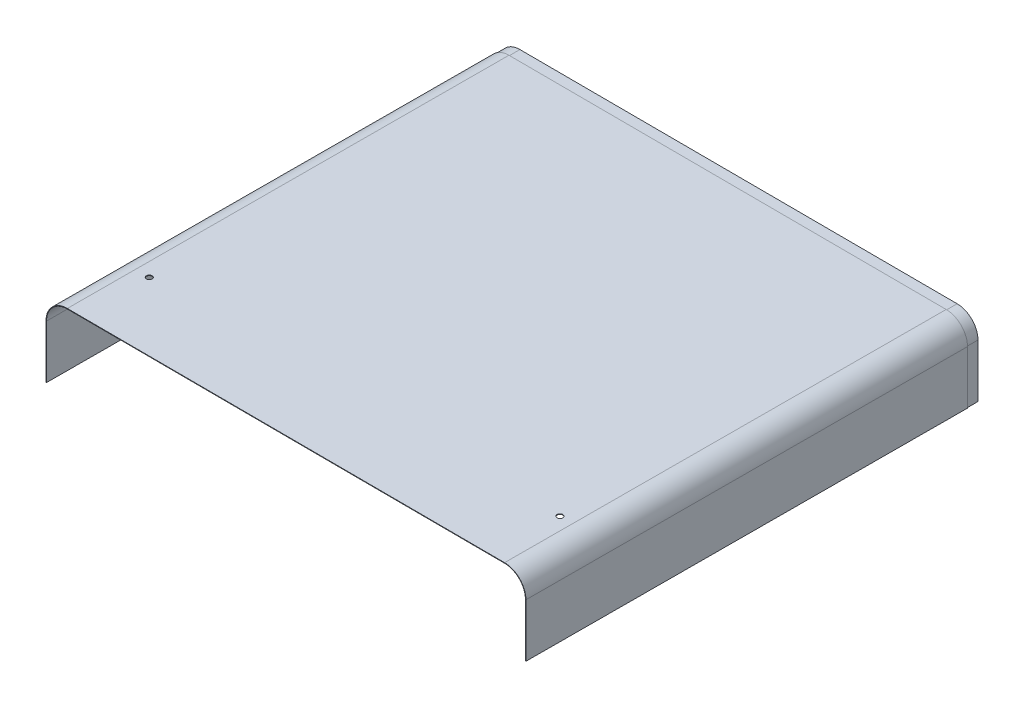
ISO-10303-21;
HEADER;
FILE_DESCRIPTION(('STEP AP214'),'2;1');
FILE_NAME('part.step','',(''),(''),'','','');
FILE_SCHEMA(('AUTOMOTIVE_DESIGN { 1 0 10303 214 1 1 1 1 }'));
ENDSEC;
DATA;
#1=APPLICATION_CONTEXT('core data for automotive mechanical design processes');
#2=APPLICATION_PROTOCOL_DEFINITION('international standard','automotive_design',2000,#1);
#3=PRODUCT_CONTEXT('',#1,'mechanical');
#4=PRODUCT('Part','Part','',(#3));
#5=PRODUCT_RELATED_PRODUCT_CATEGORY('part','',(#4));
#6=PRODUCT_DEFINITION_FORMATION('','',#4);
#7=PRODUCT_DEFINITION_CONTEXT('part definition',#1,'design');
#8=PRODUCT_DEFINITION('design','',#6,#7);
#9=PRODUCT_DEFINITION_SHAPE('','',#8);
#10=(LENGTH_UNIT() NAMED_UNIT(*) SI_UNIT(.MILLI.,.METRE.));
#11=(NAMED_UNIT(*) PLANE_ANGLE_UNIT() SI_UNIT($,.RADIAN.));
#12=(NAMED_UNIT(*) SI_UNIT($,.STERADIAN.) SOLID_ANGLE_UNIT());
#13=UNCERTAINTY_MEASURE_WITH_UNIT(LENGTH_MEASURE(1.E-05),#10,'distance_accuracy_value','');
#14=(GEOMETRIC_REPRESENTATION_CONTEXT(3) GLOBAL_UNCERTAINTY_ASSIGNED_CONTEXT((#13)) GLOBAL_UNIT_ASSIGNED_CONTEXT((#10,
#11,#12)) REPRESENTATION_CONTEXT('',''));
#15=CARTESIAN_POINT('',(0.,0.,0.));
#16=DIRECTION('',(0.,0.,1.));
#17=DIRECTION('',(1.,0.,0.));
#18=AXIS2_PLACEMENT_3D('',#15,#16,#17);
#19=CARTESIAN_POINT('',(327.378468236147,-39.9999999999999,32.7875635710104));
#20=DIRECTION('',(0.00352424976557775,0.,-0.999993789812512));
#21=DIRECTION('',(-0.999993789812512,0.,-0.00352424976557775));
#22=AXIS2_PLACEMENT_3D('',#19,#20,#21);
#23=CYLINDRICAL_SURFACE('',#22,40.0000000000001);
#24=CARTESIAN_POINT('',(327.410186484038,-39.9999999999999,23.7876194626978));
#25=DIRECTION('',(-0.00352424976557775,0.,0.999993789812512));
#26=DIRECTION('',(0.999993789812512,0.,0.00352424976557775));
#27=AXIS2_PLACEMENT_3D('',#24,#25,#26);
#28=CIRCLE('',#27,40.0000000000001);
#29=CARTESIAN_POINT('',(327.410186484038,0.,23.7876194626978));
#30=VERTEX_POINT('',#29);
#31=CARTESIAN_POINT('',(367.409938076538,-39.9999999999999,23.9285894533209));
#32=VERTEX_POINT('',#31);
#33=EDGE_CURVE('E237',#30,#32,#28,.F.);
#34=ORIENTED_EDGE('',*,*,#33,.T.);
#35=DIRECTION('',(0.00352424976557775,0.,-0.999993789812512));
#36=VECTOR('',#35,1.);
#37=CARTESIAN_POINT('',(367.378219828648,-39.9999999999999,32.9285335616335));
#38=LINE('',#37,#36);
#39=CARTESIAN_POINT('',(367.483947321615,-39.9999999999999,2.92871986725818));
#40=VERTEX_POINT('',#39);
#41=EDGE_CURVE('E29',#32,#40,#38,.T.);
#42=ORIENTED_EDGE('',*,*,#41,.T.);
#43=CARTESIAN_POINT('',(327.484195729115,-39.9999999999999,2.78774987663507));
#44=DIRECTION('',(0.00352424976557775,0.,-0.999993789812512));
#45=DIRECTION('',(-0.999993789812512,0.,-0.00352424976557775));
#46=AXIS2_PLACEMENT_3D('',#43,#44,#45);
#47=CIRCLE('',#46,40.0000000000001);
#48=CARTESIAN_POINT('',(327.484195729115,0.,2.78774987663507));
#49=VERTEX_POINT('',#48);
#50=EDGE_CURVE('E293',#49,#40,#47,.T.);
#51=ORIENTED_EDGE('',*,*,#50,.F.);
#52=DIRECTION('',(0.00352424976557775,0.,-0.999993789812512));
#53=VECTOR('',#52,1.);
#54=CARTESIAN_POINT('',(327.378468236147,0.,32.7875635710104));
#55=LINE('',#54,#53);
#56=EDGE_CURVE('E11',#30,#49,#55,.T.);
#57=ORIENTED_EDGE('',*,*,#56,.F.);
#58=EDGE_LOOP('',(#34,#42,#51,#57));
#59=FACE_BOUND('',#58,.T.);
#60=ADVANCED_FACE('F26',(#59),#23,.T.);
#61=CARTESIAN_POINT('',(-512.616315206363,0.,29.8271937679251));
#62=DIRECTION('',(0.,1.,0.));
#63=DIRECTION('',(-1.,0.,0.));
#64=AXIS2_PLACEMENT_3D('',#61,#62,#63);
#65=PLANE('',#64);
#66=DIRECTION('',(0.999993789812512,0.,0.00352424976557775));
#67=VECTOR('',#66,1.);
#68=CARTESIAN_POINT('',(-512.584596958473,0.,20.8272496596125));
#69=LINE('',#68,#67);
#70=CARTESIAN_POINT('',(-512.584596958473,0.,20.8272496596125));
#71=VERTEX_POINT('',#70);
#72=EDGE_CURVE('E41',#71,#30,#69,.T.);
#73=ORIENTED_EDGE('',*,*,#72,.T.);
#74=ORIENTED_EDGE('',*,*,#56,.T.);
#75=DIRECTION('',(0.999993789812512,0.,0.00352424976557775));
#76=VECTOR('',#75,1.);
#77=CARTESIAN_POINT('',(-512.510587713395,0.,-0.172619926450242));
#78=LINE('',#77,#76);
#79=CARTESIAN_POINT('',(-512.510587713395,0.,-0.172619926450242));
#80=VERTEX_POINT('',#79);
#81=EDGE_CURVE('E326',#80,#49,#78,.T.);
#82=ORIENTED_EDGE('',*,*,#81,.F.);
#83=DIRECTION('',(0.00352424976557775,0.,-0.999993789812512));
#84=VECTOR('',#83,1.);
#85=CARTESIAN_POINT('',(-512.616315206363,0.,29.8271937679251));
#86=LINE('',#85,#84);
#87=EDGE_CURVE('E34',#71,#80,#86,.T.);
#88=ORIENTED_EDGE('',*,*,#87,.F.);
#89=EDGE_LOOP('',(#73,#74,#82,#88));
#90=FACE_BOUND('',#89,.T.);
#91=ADVANCED_FACE('F392',(#90),#65,.T.);
#92=CARTESIAN_POINT('',(-512.616315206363,-40.,29.8271937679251));
#93=DIRECTION('',(0.00352424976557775,0.,-0.999993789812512));
#94=DIRECTION('',(-0.999993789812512,0.,-0.00352424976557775));
#95=AXIS2_PLACEMENT_3D('',#92,#93,#94);
#96=CYLINDRICAL_SURFACE('',#95,40.0000000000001);
#97=CARTESIAN_POINT('',(-512.584596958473,-40.,20.8272496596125));
#98=DIRECTION('',(-0.00352424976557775,0.,0.999993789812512));
#99=DIRECTION('',(0.999993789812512,0.,0.00352424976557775));
#100=AXIS2_PLACEMENT_3D('',#97,#98,#99);
#101=CIRCLE('',#100,40.0000000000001);
#102=CARTESIAN_POINT('',(-552.584348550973,-40.,20.6862796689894));
#103=VERTEX_POINT('',#102);
#104=EDGE_CURVE('E49',#103,#71,#101,.F.);
#105=ORIENTED_EDGE('',*,*,#104,.T.);
#106=ORIENTED_EDGE('',*,*,#87,.T.);
#107=CARTESIAN_POINT('',(-512.510587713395,-40.,-0.172619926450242));
#108=DIRECTION('',(0.00352424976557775,0.,-0.999993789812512));
#109=DIRECTION('',(-0.999993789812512,0.,-0.00352424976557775));
#110=AXIS2_PLACEMENT_3D('',#107,#108,#109);
#111=CIRCLE('',#110,40.0000000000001);
#112=CARTESIAN_POINT('',(-552.510339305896,-40.,-0.313589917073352));
#113=VERTEX_POINT('',#112);
#114=EDGE_CURVE('E323',#113,#80,#111,.T.);
#115=ORIENTED_EDGE('',*,*,#114,.F.);
#116=DIRECTION('',(0.00352424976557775,0.,-0.999993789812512));
#117=VECTOR('',#116,1.);
#118=CARTESIAN_POINT('',(-552.616066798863,-40.,29.686223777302));
#119=LINE('',#118,#117);
#120=EDGE_CURVE('E366',#103,#113,#119,.T.);
#121=ORIENTED_EDGE('',*,*,#120,.F.);
#122=EDGE_LOOP('',(#105,#106,#115,#121));
#123=FACE_BOUND('',#122,.T.);
#124=ADVANCED_FACE('F399',(#123),#96,.T.);
#125=CARTESIAN_POINT('',(-552.616066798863,-142.,29.686223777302));
#126=DIRECTION('',(-0.999993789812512,0.,-0.00352424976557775));
#127=DIRECTION('',(-0.00352424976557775,0.,0.999993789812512));
#128=AXIS2_PLACEMENT_3D('',#125,#126,#127);
#129=PLANE('',#128);
#130=DIRECTION('',(0.,1.,0.));
#131=VECTOR('',#130,1.);
#132=CARTESIAN_POINT('',(-552.584348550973,-142.,20.6862796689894));
#133=LINE('',#132,#131);
#134=CARTESIAN_POINT('',(-552.584348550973,-142.,20.6862796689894));
#135=VERTEX_POINT('',#134);
#136=EDGE_CURVE('E233',#135,#103,#133,.T.);
#137=ORIENTED_EDGE('',*,*,#136,.T.);
#138=ORIENTED_EDGE('',*,*,#120,.T.);
#139=DIRECTION('',(0.,1.,0.));
#140=VECTOR('',#139,1.);
#141=CARTESIAN_POINT('',(-552.510339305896,-142.,-0.313589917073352));
#142=LINE('',#141,#140);
#143=CARTESIAN_POINT('',(-552.510339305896,-142.,-0.313589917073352));
#144=VERTEX_POINT('',#143);
#145=EDGE_CURVE('E320',#144,#113,#142,.T.);
#146=ORIENTED_EDGE('',*,*,#145,.F.);
#147=DIRECTION('',(0.00352424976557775,0.,-0.999993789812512));
#148=VECTOR('',#147,1.);
#149=CARTESIAN_POINT('',(-552.616066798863,-142.,29.686223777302));
#150=LINE('',#149,#148);
#151=EDGE_CURVE('E368',#135,#144,#150,.T.);
#152=ORIENTED_EDGE('',*,*,#151,.F.);
#153=EDGE_LOOP('',(#137,#138,#146,#152));
#154=FACE_BOUND('',#153,.T.);
#155=ADVANCED_FACE('F397',(#154),#129,.T.);
#156=CARTESIAN_POINT('',(-551.616073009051,-142.,29.6897480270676));
#157=DIRECTION('',(0.,-1.,0.));
#158=DIRECTION('',(0.,0.,-1.));
#159=AXIS2_PLACEMENT_3D('',#156,#157,#158);
#160=PLANE('',#159);
#161=DIRECTION('',(-0.999993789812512,0.,-0.00352424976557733));
#162=VECTOR('',#161,1.);
#163=CARTESIAN_POINT('',(-551.510345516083,-142.,-0.310065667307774));
#164=LINE('',#163,#162);
#165=CARTESIAN_POINT('',(-551.510345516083,-142.,-0.310065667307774));
#166=VERTEX_POINT('',#165);
#167=EDGE_CURVE('E317',#166,#144,#164,.T.);
#168=ORIENTED_EDGE('',*,*,#167,.F.);
#169=DIRECTION('',(0.00352424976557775,0.,-0.999993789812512));
#170=VECTOR('',#169,1.);
#171=CARTESIAN_POINT('',(-551.616073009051,-142.,29.6897480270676));
#172=LINE('',#171,#170);
#173=CARTESIAN_POINT('',(-551.616073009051,-142.,29.6897480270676));
#174=VERTEX_POINT('',#173);
#175=EDGE_CURVE('E370',#174,#166,#172,.T.);
#176=ORIENTED_EDGE('',*,*,#175,.F.);
#177=DIRECTION('',(-0.999993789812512,0.,-0.00352424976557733));
#178=VECTOR('',#177,1.);
#179=CARTESIAN_POINT('',(-551.616073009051,-142.,29.6897480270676));
#180=LINE('',#179,#178);
#181=CARTESIAN_POINT('',(-552.616066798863,-142.,29.686223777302));
#182=VERTEX_POINT('',#181);
#183=EDGE_CURVE('E353',#174,#182,#180,.T.);
#184=ORIENTED_EDGE('',*,*,#183,.T.);
#185=DIRECTION('',(0.00352424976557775,0.,-0.999993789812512));
#186=VECTOR('',#185,1.);
#187=CARTESIAN_POINT('',(-555.553324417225,-142.,863.123004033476));
#188=LINE('',#187,#186);
#189=CARTESIAN_POINT('',(-555.553324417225,-142.,863.123004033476));
#190=VERTEX_POINT('',#189);
#191=EDGE_CURVE('E279',#190,#182,#188,.T.);
#192=ORIENTED_EDGE('',*,*,#191,.F.);
#193=DIRECTION('',(-0.999993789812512,0.,-0.00352424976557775));
#194=VECTOR('',#193,1.);
#195=CARTESIAN_POINT('',(-555.553324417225,-142.,863.123004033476));
#196=LINE('',#195,#194);
#197=CARTESIAN_POINT('',(-556.553318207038,-142.,863.11947978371));
#198=VERTEX_POINT('',#197);
#199=EDGE_CURVE('E256',#190,#198,#196,.T.);
#200=ORIENTED_EDGE('',*,*,#199,.T.);
#201=DIRECTION('',(0.00352424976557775,0.,-0.999993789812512));
#202=VECTOR('',#201,1.);
#203=CARTESIAN_POINT('',(-556.553318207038,-142.,863.11947978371));
#204=LINE('',#203,#202);
#205=CARTESIAN_POINT('',(-553.584342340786,-142.,20.6827554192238));
#206=VERTEX_POINT('',#205);
#207=EDGE_CURVE('E282',#198,#206,#204,.T.);
#208=ORIENTED_EDGE('',*,*,#207,.T.);
#209=DIRECTION('',(-0.999993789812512,0.,-0.00352424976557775));
#210=VECTOR('',#209,1.);
#211=CARTESIAN_POINT('',(-552.584348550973,-142.,20.6862796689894));
#212=LINE('',#211,#210);
#213=EDGE_CURVE('E230',#135,#206,#212,.T.);
#214=ORIENTED_EDGE('',*,*,#213,.F.);
#215=ORIENTED_EDGE('',*,*,#151,.T.);
#216=EDGE_LOOP('',(#168,#176,#184,#192,#200,#208,#214,#215));
#217=FACE_BOUND('',#216,.T.);
#218=ADVANCED_FACE('F403',(#217),#160,.T.);
#219=CARTESIAN_POINT('',(-551.616073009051,-40.,29.6897480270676));
#220=DIRECTION('',(0.999993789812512,0.,0.00352424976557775));
#221=DIRECTION('',(0.00352424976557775,0.,-0.999993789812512));
#222=AXIS2_PLACEMENT_3D('',#219,#220,#221);
#223=PLANE('',#222);
#224=DIRECTION('',(0.,-1.,0.));
#225=VECTOR('',#224,1.);
#226=CARTESIAN_POINT('',(-551.510345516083,-40.,-0.310065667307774));
#227=LINE('',#226,#225);
#228=CARTESIAN_POINT('',(-551.510345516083,-40.,-0.310065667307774));
#229=VERTEX_POINT('',#228);
#230=EDGE_CURVE('E314',#229,#166,#227,.T.);
#231=ORIENTED_EDGE('',*,*,#230,.F.);
#232=DIRECTION('',(0.00352424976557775,0.,-0.999993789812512));
#233=VECTOR('',#232,1.);
#234=CARTESIAN_POINT('',(-551.616073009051,-40.,29.6897480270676));
#235=LINE('',#234,#233);
#236=CARTESIAN_POINT('',(-551.616073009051,-40.,29.6897480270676));
#237=VERTEX_POINT('',#236);
#238=EDGE_CURVE('E372',#237,#229,#235,.T.);
#239=ORIENTED_EDGE('',*,*,#238,.F.);
#240=DIRECTION('',(0.,-1.,0.));
#241=VECTOR('',#240,1.);
#242=CARTESIAN_POINT('',(-551.616073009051,-40.,29.6897480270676));
#243=LINE('',#242,#241);
#244=EDGE_CURVE('E350',#237,#174,#243,.T.);
#245=ORIENTED_EDGE('',*,*,#244,.T.);
#246=ORIENTED_EDGE('',*,*,#175,.T.);
#247=EDGE_LOOP('',(#231,#239,#245,#246));
#248=FACE_BOUND('',#247,.T.);
#249=ADVANCED_FACE('F448',(#248),#223,.T.);
#250=CARTESIAN_POINT('',(-512.616315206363,-40.,29.8271937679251));
#251=DIRECTION('',(0.00352424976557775,0.,-0.999993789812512));
#252=DIRECTION('',(-0.999993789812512,0.,-0.00352424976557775));
#253=AXIS2_PLACEMENT_3D('',#250,#251,#252);
#254=CYLINDRICAL_SURFACE('',#253,39.);
#255=CARTESIAN_POINT('',(-512.510587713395,-40.,-0.172619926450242));
#256=DIRECTION('',(-0.00352424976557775,0.,0.999993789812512));
#257=DIRECTION('',(-0.999993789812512,0.,-0.00352424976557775));
#258=AXIS2_PLACEMENT_3D('',#255,#256,#257);
#259=CIRCLE('',#258,39.);
#260=CARTESIAN_POINT('',(-512.510587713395,-0.999999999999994,-0.172619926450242));
#261=VERTEX_POINT('',#260);
#262=EDGE_CURVE('E311',#261,#229,#259,.T.);
#263=ORIENTED_EDGE('',*,*,#262,.F.);
#264=DIRECTION('',(0.00352424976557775,0.,-0.999993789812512));
#265=VECTOR('',#264,1.);
#266=CARTESIAN_POINT('',(-512.616315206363,-0.999999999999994,29.8271937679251));
#267=LINE('',#266,#265);
#268=CARTESIAN_POINT('',(-512.616315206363,-0.999999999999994,29.8271937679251));
#269=VERTEX_POINT('',#268);
#270=EDGE_CURVE('E374',#269,#261,#267,.T.);
#271=ORIENTED_EDGE('',*,*,#270,.F.);
#272=CARTESIAN_POINT('',(-512.616315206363,-40.,29.8271937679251));
#273=DIRECTION('',(-0.00352424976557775,0.,0.999993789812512));
#274=DIRECTION('',(-0.999993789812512,0.,-0.00352424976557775));
#275=AXIS2_PLACEMENT_3D('',#272,#273,#274);
#276=CIRCLE('',#275,39.);
#277=EDGE_CURVE('E347',#269,#237,#276,.T.);
#278=ORIENTED_EDGE('',*,*,#277,.T.);
#279=ORIENTED_EDGE('',*,*,#238,.T.);
#280=EDGE_LOOP('',(#263,#271,#278,#279));
#281=FACE_BOUND('',#280,.T.);
#282=ADVANCED_FACE('F451',(#281),#254,.F.);
#283=CARTESIAN_POINT('',(327.378468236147,-0.999999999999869,32.7875635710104));
#284=DIRECTION('',(0.,-1.,0.));
#285=DIRECTION('',(1.,0.,0.));
#286=AXIS2_PLACEMENT_3D('',#283,#284,#285);
#287=PLANE('',#286);
#288=DIRECTION('',(-0.999993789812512,0.,-0.00352424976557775));
#289=VECTOR('',#288,1.);
#290=CARTESIAN_POINT('',(327.484195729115,-0.999999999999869,2.78774987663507));
#291=LINE('',#290,#289);
#292=CARTESIAN_POINT('',(327.484195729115,-0.999999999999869,2.78774987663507));
#293=VERTEX_POINT('',#292);
#294=EDGE_CURVE('E308',#293,#261,#291,.T.);
#295=ORIENTED_EDGE('',*,*,#294,.F.);
#296=DIRECTION('',(0.00352424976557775,0.,-0.999993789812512));
#297=VECTOR('',#296,1.);
#298=CARTESIAN_POINT('',(327.378468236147,-0.999999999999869,32.7875635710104));
#299=LINE('',#298,#297);
#300=CARTESIAN_POINT('',(327.378468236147,-0.999999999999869,32.7875635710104));
#301=VERTEX_POINT('',#300);
#302=EDGE_CURVE('E376',#301,#293,#299,.T.);
#303=ORIENTED_EDGE('',*,*,#302,.F.);
#304=DIRECTION('',(-0.999993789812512,0.,-0.00352424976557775));
#305=VECTOR('',#304,1.);
#306=CARTESIAN_POINT('',(327.378468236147,-0.999999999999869,32.7875635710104));
#307=LINE('',#306,#305);
#308=EDGE_CURVE('E344',#301,#269,#307,.T.);
#309=ORIENTED_EDGE('',*,*,#308,.T.);
#310=ORIENTED_EDGE('',*,*,#270,.T.);
#311=EDGE_LOOP('',(#295,#303,#309,#310));
#312=FACE_BOUND('',#311,.T.);
#313=ADVANCED_FACE('F456',(#312),#287,.T.);
#314=CARTESIAN_POINT('',(327.378468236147,-39.9999999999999,32.7875635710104));
#315=DIRECTION('',(0.00352424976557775,0.,-0.999993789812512));
#316=DIRECTION('',(-0.999993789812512,0.,-0.00352424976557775));
#317=AXIS2_PLACEMENT_3D('',#314,#315,#316);
#318=CYLINDRICAL_SURFACE('',#317,39.0000000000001);
#319=CARTESIAN_POINT('',(327.484195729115,-39.9999999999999,2.78774987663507));
#320=DIRECTION('',(-0.00352424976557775,0.,0.999993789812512));
#321=DIRECTION('',(-0.999993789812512,0.,-0.00352424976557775));
#322=AXIS2_PLACEMENT_3D('',#319,#320,#321);
#323=CIRCLE('',#322,39.0000000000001);
#324=CARTESIAN_POINT('',(366.483953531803,-39.9999999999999,2.9251956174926));
#325=VERTEX_POINT('',#324);
#326=EDGE_CURVE('E305',#325,#293,#323,.T.);
#327=ORIENTED_EDGE('',*,*,#326,.F.);
#328=DIRECTION('',(0.00352424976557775,0.,-0.999993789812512));
#329=VECTOR('',#328,1.);
#330=CARTESIAN_POINT('',(366.378226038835,-39.9999999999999,32.925009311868));
#331=LINE('',#330,#329);
#332=CARTESIAN_POINT('',(366.378226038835,-39.9999999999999,32.925009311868));
#333=VERTEX_POINT('',#332);
#334=EDGE_CURVE('E378',#333,#325,#331,.T.);
#335=ORIENTED_EDGE('',*,*,#334,.F.);
#336=CARTESIAN_POINT('',(327.378468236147,-39.9999999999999,32.7875635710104));
#337=DIRECTION('',(-0.00352424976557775,0.,0.999993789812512));
#338=DIRECTION('',(-0.999993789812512,0.,-0.00352424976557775));
#339=AXIS2_PLACEMENT_3D('',#336,#337,#338);
#340=CIRCLE('',#339,39.0000000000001);
#341=EDGE_CURVE('E341',#333,#301,#340,.T.);
#342=ORIENTED_EDGE('',*,*,#341,.T.);
#343=ORIENTED_EDGE('',*,*,#302,.T.);
#344=EDGE_LOOP('',(#327,#335,#342,#343));
#345=FACE_BOUND('',#344,.T.);
#346=ADVANCED_FACE('F459',(#345),#318,.F.);
#347=CARTESIAN_POINT('',(366.378226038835,-142.,32.925009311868));
#348=DIRECTION('',(-0.999993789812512,0.,-0.00352424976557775));
#349=DIRECTION('',(-0.00352424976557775,0.,0.999993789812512));
#350=AXIS2_PLACEMENT_3D('',#347,#348,#349);
#351=PLANE('',#350);
#352=DIRECTION('',(0.,1.,0.));
#353=VECTOR('',#352,1.);
#354=CARTESIAN_POINT('',(366.483953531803,-142.,2.9251956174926));
#355=LINE('',#354,#353);
#356=CARTESIAN_POINT('',(366.483953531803,-142.,2.9251956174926));
#357=VERTEX_POINT('',#356);
#358=EDGE_CURVE('E302',#357,#325,#355,.T.);
#359=ORIENTED_EDGE('',*,*,#358,.F.);
#360=DIRECTION('',(0.00352424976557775,0.,-0.999993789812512));
#361=VECTOR('',#360,1.);
#362=CARTESIAN_POINT('',(366.378226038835,-142.,32.925009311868));
#363=LINE('',#362,#361);
#364=CARTESIAN_POINT('',(366.378226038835,-142.,32.925009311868));
#365=VERTEX_POINT('',#364);
#366=EDGE_CURVE('E380',#365,#357,#363,.T.);
#367=ORIENTED_EDGE('',*,*,#366,.F.);
#368=DIRECTION('',(0.,1.,0.));
#369=VECTOR('',#368,1.);
#370=CARTESIAN_POINT('',(366.378226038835,-142.,32.925009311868));
#371=LINE('',#370,#369);
#372=EDGE_CURVE('E338',#365,#333,#371,.T.);
#373=ORIENTED_EDGE('',*,*,#372,.T.);
#374=ORIENTED_EDGE('',*,*,#334,.T.);
#375=EDGE_LOOP('',(#359,#367,#373,#374));
#376=FACE_BOUND('',#375,.T.);
#377=ADVANCED_FACE('F462',(#376),#351,.T.);
#378=CARTESIAN_POINT('',(367.378219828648,-142.,32.9285335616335));
#379=DIRECTION('',(0.,-1.,0.));
#380=DIRECTION('',(0.,0.,-1.));
#381=AXIS2_PLACEMENT_3D('',#378,#379,#380);
#382=PLANE('',#381);
#383=DIRECTION('',(-0.999993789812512,0.,-0.00352424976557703));
#384=VECTOR('',#383,1.);
#385=CARTESIAN_POINT('',(367.483947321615,-142.,2.92871986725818));
#386=LINE('',#385,#384);
#387=CARTESIAN_POINT('',(367.483947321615,-142.,2.92871986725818));
#388=VERTEX_POINT('',#387);
#389=EDGE_CURVE('E299',#388,#357,#386,.T.);
#390=ORIENTED_EDGE('',*,*,#389,.F.);
#391=DIRECTION('',(0.00352424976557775,0.,-0.999993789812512));
#392=VECTOR('',#391,1.);
#393=CARTESIAN_POINT('',(367.378219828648,-142.,32.9285335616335));
#394=LINE('',#393,#392);
#395=CARTESIAN_POINT('',(367.409938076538,-142.,23.9285894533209));
#396=VERTEX_POINT('',#395);
#397=EDGE_CURVE('E214',#396,#388,#394,.T.);
#398=ORIENTED_EDGE('',*,*,#397,.F.);
#399=DIRECTION('',(-0.999993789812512,0.,-0.00352424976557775));
#400=VECTOR('',#399,1.);
#401=CARTESIAN_POINT('',(368.409931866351,-142.,23.9321137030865));
#402=LINE('',#401,#400);
#403=CARTESIAN_POINT('',(368.409931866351,-142.,23.9321137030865));
#404=VERTEX_POINT('',#403);
#405=EDGE_CURVE('E206',#404,#396,#402,.T.);
#406=ORIENTED_EDGE('',*,*,#405,.F.);
#407=DIRECTION('',(0.00352424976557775,0.,-0.999993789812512));
#408=VECTOR('',#407,1.);
#409=CARTESIAN_POINT('',(365.440956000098,-142.,866.368838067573));
#410=LINE('',#409,#408);
#411=CARTESIAN_POINT('',(365.440956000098,-142.,866.368838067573));
#412=VERTEX_POINT('',#411);
#413=EDGE_CURVE('E188',#412,#404,#410,.T.);
#414=ORIENTED_EDGE('',*,*,#413,.F.);
#415=DIRECTION('',(-0.999993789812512,0.,-0.00352424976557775));
#416=VECTOR('',#415,1.);
#417=CARTESIAN_POINT('',(365.440956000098,-142.,866.368838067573));
#418=LINE('',#417,#416);
#419=CARTESIAN_POINT('',(364.440962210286,-142.,866.365313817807));
#420=VERTEX_POINT('',#419);
#421=EDGE_CURVE('E241',#412,#420,#418,.T.);
#422=ORIENTED_EDGE('',*,*,#421,.T.);
#423=DIRECTION('',(0.00352424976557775,0.,-0.999993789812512));
#424=VECTOR('',#423,1.);
#425=CARTESIAN_POINT('',(364.440962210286,-142.,866.365313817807));
#426=LINE('',#425,#424);
#427=CARTESIAN_POINT('',(367.378219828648,-142.,32.9285335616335));
#428=VERTEX_POINT('',#427);
#429=EDGE_CURVE('E198',#420,#428,#426,.T.);
#430=ORIENTED_EDGE('',*,*,#429,.T.);
#431=DIRECTION('',(-0.999993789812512,0.,-0.00352424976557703));
#432=VECTOR('',#431,1.);
#433=CARTESIAN_POINT('',(367.378219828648,-142.,32.9285335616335));
#434=LINE('',#433,#432);
#435=EDGE_CURVE('E335',#428,#365,#434,.T.);
#436=ORIENTED_EDGE('',*,*,#435,.T.);
#437=ORIENTED_EDGE('',*,*,#366,.T.);
#438=EDGE_LOOP('',(#390,#398,#406,#414,#422,#430,#436,#437));
#439=FACE_BOUND('',#438,.T.);
#440=ADVANCED_FACE('F213',(#439),#382,.T.);
#441=CARTESIAN_POINT('',(367.378219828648,-39.9999999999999,32.9285335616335));
#442=DIRECTION('',(0.999993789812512,0.,0.00352424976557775));
#443=DIRECTION('',(0.00352424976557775,0.,-0.999993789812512));
#444=AXIS2_PLACEMENT_3D('',#441,#442,#443);
#445=PLANE('',#444);
#446=DIRECTION('',(0.,-1.,0.));
#447=VECTOR('',#446,1.);
#448=CARTESIAN_POINT('',(367.409938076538,-39.9999999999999,23.9285894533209));
#449=LINE('',#448,#447);
#450=EDGE_CURVE('E215',#32,#396,#449,.T.);
#451=ORIENTED_EDGE('',*,*,#450,.T.);
#452=ORIENTED_EDGE('',*,*,#397,.T.);
#453=DIRECTION('',(0.,-1.,0.));
#454=VECTOR('',#453,1.);
#455=CARTESIAN_POINT('',(367.483947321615,-39.9999999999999,2.92871986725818));
#456=LINE('',#455,#454);
#457=EDGE_CURVE('E296',#40,#388,#456,.T.);
#458=ORIENTED_EDGE('',*,*,#457,.F.);
#459=ORIENTED_EDGE('',*,*,#41,.F.);
#460=EDGE_LOOP('',(#451,#452,#458,#459));
#461=FACE_BOUND('',#460,.T.);
#462=ADVANCED_FACE('F387',(#461),#445,.T.);
#463=CARTESIAN_POINT('',(327.378468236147,-39.9999999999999,32.7875635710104));
#464=DIRECTION('',(0.00352424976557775,0.,-0.999993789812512));
#465=DIRECTION('',(-0.999993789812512,0.,-0.00352424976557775));
#466=AXIS2_PLACEMENT_3D('',#463,#464,#465);
#467=PLANE('',#466);
#468=CARTESIAN_POINT('',(327.378468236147,-39.9999999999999,32.7875635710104));
#469=DIRECTION('',(0.00352424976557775,0.,-0.999993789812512));
#470=DIRECTION('',(-0.999993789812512,0.,-0.00352424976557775));
#471=AXIS2_PLACEMENT_3D('',#468,#469,#470);
#472=CIRCLE('',#471,40.0000000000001);
#473=CARTESIAN_POINT('',(327.378468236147,0.,32.7875635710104));
#474=VERTEX_POINT('',#473);
#475=CARTESIAN_POINT('',(367.378219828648,-39.9999999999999,32.9285335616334));
#476=VERTEX_POINT('',#475);
#477=EDGE_CURVE('E329',#474,#476,#472,.T.);
#478=ORIENTED_EDGE('',*,*,#477,.F.);
#479=DIRECTION('',(0.999993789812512,0.,0.00352424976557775));
#480=VECTOR('',#479,1.);
#481=CARTESIAN_POINT('',(-512.616315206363,0.,29.8271937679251));
#482=LINE('',#481,#480);
#483=CARTESIAN_POINT('',(-512.616315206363,0.,29.8271937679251));
#484=VERTEX_POINT('',#483);
#485=EDGE_CURVE('E362',#484,#474,#482,.T.);
#486=ORIENTED_EDGE('',*,*,#485,.F.);
#487=CARTESIAN_POINT('',(-512.616315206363,-40.,29.8271937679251));
#488=DIRECTION('',(0.00352424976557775,0.,-0.999993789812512));
#489=DIRECTION('',(-0.999993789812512,0.,-0.00352424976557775));
#490=AXIS2_PLACEMENT_3D('',#487,#488,#489);
#491=CIRCLE('',#490,40.0000000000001);
#492=CARTESIAN_POINT('',(-552.616066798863,-40.,29.686223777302));
#493=VERTEX_POINT('',#492);
#494=EDGE_CURVE('E359',#493,#484,#491,.T.);
#495=ORIENTED_EDGE('',*,*,#494,.F.);
#496=DIRECTION('',(0.,1.,0.));
#497=VECTOR('',#496,1.);
#498=CARTESIAN_POINT('',(-552.616066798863,-142.,29.686223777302));
#499=LINE('',#498,#497);
#500=EDGE_CURVE('E356',#182,#493,#499,.T.);
#501=ORIENTED_EDGE('',*,*,#500,.F.);
#502=ORIENTED_EDGE('',*,*,#183,.F.);
#503=ORIENTED_EDGE('',*,*,#244,.F.);
#504=ORIENTED_EDGE('',*,*,#277,.F.);
#505=ORIENTED_EDGE('',*,*,#308,.F.);
#506=ORIENTED_EDGE('',*,*,#341,.F.);
#507=ORIENTED_EDGE('',*,*,#372,.F.);
#508=ORIENTED_EDGE('',*,*,#435,.F.);
#509=DIRECTION('',(0.,-1.,0.));
#510=VECTOR('',#509,1.);
#511=CARTESIAN_POINT('',(367.378219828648,-39.9999999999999,32.9285335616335));
#512=LINE('',#511,#510);
#513=EDGE_CURVE('E332',#476,#428,#512,.T.);
#514=ORIENTED_EDGE('',*,*,#513,.F.);
#515=EDGE_LOOP('',(#478,#486,#495,#501,#502,#503,#504,#505,#506,#507,#508,#514));
#516=FACE_BOUND('',#515,.T.);
#517=ADVANCED_FACE('F428',(#516),#467,.F.);
#518=CARTESIAN_POINT('',(327.484195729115,-39.9999999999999,2.78774987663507));
#519=DIRECTION('',(0.00352424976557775,0.,-0.999993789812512));
#520=DIRECTION('',(-0.999993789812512,0.,-0.00352424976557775));
#521=AXIS2_PLACEMENT_3D('',#518,#519,#520);
#522=PLANE('',#521);
#523=ORIENTED_EDGE('',*,*,#50,.T.);
#524=ORIENTED_EDGE('',*,*,#457,.T.);
#525=ORIENTED_EDGE('',*,*,#389,.T.);
#526=ORIENTED_EDGE('',*,*,#358,.T.);
#527=ORIENTED_EDGE('',*,*,#326,.T.);
#528=ORIENTED_EDGE('',*,*,#294,.T.);
#529=ORIENTED_EDGE('',*,*,#262,.T.);
#530=ORIENTED_EDGE('',*,*,#230,.T.);
#531=ORIENTED_EDGE('',*,*,#167,.T.);
#532=ORIENTED_EDGE('',*,*,#145,.T.);
#533=ORIENTED_EDGE('',*,*,#114,.T.);
#534=ORIENTED_EDGE('',*,*,#81,.T.);
#535=EDGE_LOOP('',(#523,#524,#525,#526,#527,#528,#529,#530,#531,#532,#533,#534));
#536=FACE_BOUND('',#535,.T.);
#537=ADVANCED_FACE('F389',(#536),#522,.T.);
#538=CARTESIAN_POINT('',(364.440962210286,-39.9999999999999,866.365313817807));
#539=DIRECTION('',(0.999993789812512,0.,0.00352424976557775));
#540=DIRECTION('',(0.00352424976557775,0.,-0.999993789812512));
#541=AXIS2_PLACEMENT_3D('',#538,#539,#540);
#542=PLANE('',#541);
#543=DIRECTION('',(0.00352424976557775,0.,-0.999993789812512));
#544=VECTOR('',#543,1.);
#545=CARTESIAN_POINT('',(364.440962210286,-39.9999999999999,866.365313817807));
#546=LINE('',#545,#544);
#547=CARTESIAN_POINT('',(364.440962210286,-39.9999999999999,866.365313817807));
#548=VERTEX_POINT('',#547);
#549=EDGE_CURVE('E267',#548,#476,#546,.T.);
#550=ORIENTED_EDGE('',*,*,#549,.T.);
#551=ORIENTED_EDGE('',*,*,#513,.T.);
#552=ORIENTED_EDGE('',*,*,#429,.F.);
#553=DIRECTION('',(0.,-1.,0.));
#554=VECTOR('',#553,1.);
#555=CARTESIAN_POINT('',(364.440962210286,-39.9999999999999,866.365313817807));
#556=LINE('',#555,#554);
#557=EDGE_CURVE('E239',#548,#420,#556,.T.);
#558=ORIENTED_EDGE('',*,*,#557,.F.);
#559=EDGE_LOOP('',(#550,#551,#552,#558));
#560=FACE_BOUND('',#559,.T.);
#561=ADVANCED_FACE('F425',(#560),#542,.F.);
#562=CARTESIAN_POINT('',(-555.553324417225,-142.,863.123004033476));
#563=DIRECTION('',(-0.999993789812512,0.,-0.00352424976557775));
#564=DIRECTION('',(-0.00352424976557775,0.,0.999993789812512));
#565=AXIS2_PLACEMENT_3D('',#562,#563,#564);
#566=PLANE('',#565);
#567=ORIENTED_EDGE('',*,*,#191,.T.);
#568=ORIENTED_EDGE('',*,*,#500,.T.);
#569=DIRECTION('',(0.00352424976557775,0.,-0.999993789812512));
#570=VECTOR('',#569,1.);
#571=CARTESIAN_POINT('',(-555.553324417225,-40.,863.123004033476));
#572=LINE('',#571,#570);
#573=CARTESIAN_POINT('',(-555.553324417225,-40.,863.123004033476));
#574=VERTEX_POINT('',#573);
#575=EDGE_CURVE('E276',#574,#493,#572,.T.);
#576=ORIENTED_EDGE('',*,*,#575,.F.);
#577=DIRECTION('',(0.,1.,0.));
#578=VECTOR('',#577,1.);
#579=CARTESIAN_POINT('',(-555.553324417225,-142.,863.123004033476));
#580=LINE('',#579,#578);
#581=EDGE_CURVE('E259',#190,#574,#580,.T.);
#582=ORIENTED_EDGE('',*,*,#581,.F.);
#583=EDGE_LOOP('',(#567,#568,#576,#582));
#584=FACE_BOUND('',#583,.T.);
#585=ADVANCED_FACE('F444',(#584),#566,.F.);
#586=CARTESIAN_POINT('',(-515.553572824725,-40.,863.263974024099));
#587=DIRECTION('',(0.00352424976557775,0.,-0.999993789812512));
#588=DIRECTION('',(-0.999993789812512,0.,-0.00352424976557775));
#589=AXIS2_PLACEMENT_3D('',#586,#587,#588);
#590=CYLINDRICAL_SURFACE('',#589,40.0000000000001);
#591=ORIENTED_EDGE('',*,*,#575,.T.);
#592=ORIENTED_EDGE('',*,*,#494,.T.);
#593=DIRECTION('',(0.00352424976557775,0.,-0.999993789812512));
#594=VECTOR('',#593,1.);
#595=CARTESIAN_POINT('',(-515.553572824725,0.,863.263974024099));
#596=LINE('',#595,#594);
#597=CARTESIAN_POINT('',(-515.553572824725,0.,863.263974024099));
#598=VERTEX_POINT('',#597);
#599=EDGE_CURVE('E273',#598,#484,#596,.T.);
#600=ORIENTED_EDGE('',*,*,#599,.F.);
#601=CARTESIAN_POINT('',(-515.553572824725,-40.,863.263974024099));
#602=DIRECTION('',(-0.00352424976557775,0.,0.999993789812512));
#603=DIRECTION('',(0.999993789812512,0.,0.00352424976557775));
#604=AXIS2_PLACEMENT_3D('',#601,#602,#603);
#605=CIRCLE('',#604,40.0000000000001);
#606=EDGE_CURVE('E261',#574,#598,#605,.F.);
#607=ORIENTED_EDGE('',*,*,#606,.F.);
#608=EDGE_LOOP('',(#591,#592,#600,#607));
#609=FACE_BOUND('',#608,.T.);
#610=ADVANCED_FACE('F439',(#609),#590,.F.);
#611=CARTESIAN_POINT('',(-515.553572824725,0.,863.263974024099));
#612=DIRECTION('',(0.,1.,0.));
#613=DIRECTION('',(-1.,0.,0.));
#614=AXIS2_PLACEMENT_3D('',#611,#612,#613);
#615=PLANE('',#614);
#616=CARTESIAN_POINT('',(-488.595584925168,0.,733.35817396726));
#617=DIRECTION('',(0.,1.,0.));
#618=DIRECTION('',(-1.,0.,0.));
#619=AXIS2_PLACEMENT_3D('',#616,#617,#618);
#620=CIRCLE('',#619,5.50000000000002);
#621=CARTESIAN_POINT('',(-494.095584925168,0.,733.35817396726));
#622=VERTEX_POINT('',#621);
#623=EDGE_CURVE('E594',#622,#622,#620,.T.);
#624=ORIENTED_EDGE('',*,*,#623,.T.);
#625=EDGE_LOOP('',(#624));
#626=FACE_BOUND('',#625,.T.);
#627=CARTESIAN_POINT('',(300.399515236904,1.02348685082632E-13,736.138807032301));
#628=DIRECTION('',(0.,1.,0.));
#629=DIRECTION('',(-1.,0.,0.));
#630=AXIS2_PLACEMENT_3D('',#627,#628,#629);
#631=CIRCLE('',#630,5.50000000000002);
#632=CARTESIAN_POINT('',(294.899515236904,1.01797806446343E-13,736.138807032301));
#633=VERTEX_POINT('',#632);
#634=EDGE_CURVE('E217',#633,#633,#631,.T.);
#635=ORIENTED_EDGE('',*,*,#634,.T.);
#636=EDGE_LOOP('',(#635));
#637=FACE_BOUND('',#636,.T.);
#638=ORIENTED_EDGE('',*,*,#599,.T.);
#639=ORIENTED_EDGE('',*,*,#485,.T.);
#640=DIRECTION('',(0.00352424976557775,0.,-0.999993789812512));
#641=VECTOR('',#640,1.);
#642=CARTESIAN_POINT('',(324.441210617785,1.38594814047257E-13,866.224343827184));
#643=LINE('',#642,#641);
#644=CARTESIAN_POINT('',(324.441210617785,1.38594814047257E-13,866.224343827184));
#645=VERTEX_POINT('',#644);
#646=EDGE_CURVE('E270',#645,#474,#643,.T.);
#647=ORIENTED_EDGE('',*,*,#646,.F.);
#648=DIRECTION('',(0.999993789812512,0.,0.00352424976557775));
#649=VECTOR('',#648,1.);
#650=CARTESIAN_POINT('',(-515.553572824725,0.,863.263974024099));
#651=LINE('',#650,#649);
#652=EDGE_CURVE('E263',#598,#645,#651,.T.);
#653=ORIENTED_EDGE('',*,*,#652,.F.);
#654=EDGE_LOOP('',(#638,#639,#647,#653));
#655=FACE_BOUND('',#654,.T.);
#656=ADVANCED_FACE('F436',(#626,#637,#655),#615,.F.);
#657=CARTESIAN_POINT('',(324.441210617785,-39.9999999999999,866.224343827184));
#658=DIRECTION('',(0.00352424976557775,0.,-0.999993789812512));
#659=DIRECTION('',(-0.999993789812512,0.,-0.00352424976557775));
#660=AXIS2_PLACEMENT_3D('',#657,#658,#659);
#661=CYLINDRICAL_SURFACE('',#660,40.0000000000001);
#662=ORIENTED_EDGE('',*,*,#646,.T.);
#663=ORIENTED_EDGE('',*,*,#477,.T.);
#664=ORIENTED_EDGE('',*,*,#549,.F.);
#665=CARTESIAN_POINT('',(324.441210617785,-39.9999999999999,866.224343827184));
#666=DIRECTION('',(-0.00352424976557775,0.,0.999993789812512));
#667=DIRECTION('',(0.999993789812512,0.,0.00352424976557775));
#668=AXIS2_PLACEMENT_3D('',#665,#666,#667);
#669=CIRCLE('',#668,40.0000000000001);
#670=EDGE_CURVE('E265',#645,#548,#669,.F.);
#671=ORIENTED_EDGE('',*,*,#670,.F.);
#672=EDGE_LOOP('',(#662,#663,#664,#671));
#673=FACE_BOUND('',#672,.T.);
#674=ADVANCED_FACE('F431',(#673),#661,.F.);
#675=CARTESIAN_POINT('',(365.440956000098,-39.9999999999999,866.368838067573));
#676=DIRECTION('',(0.999993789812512,0.,0.00352424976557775));
#677=DIRECTION('',(0.00352424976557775,0.,-0.999993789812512));
#678=AXIS2_PLACEMENT_3D('',#675,#676,#677);
#679=PLANE('',#678);
#680=ORIENTED_EDGE('',*,*,#413,.T.);
#681=DIRECTION('',(0.,-1.,0.));
#682=VECTOR('',#681,1.);
#683=CARTESIAN_POINT('',(368.409931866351,-39.9999999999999,23.9321137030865));
#684=LINE('',#683,#682);
#685=CARTESIAN_POINT('',(368.409931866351,-39.9999999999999,23.9321137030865));
#686=VERTEX_POINT('',#685);
#687=EDGE_CURVE('E191',#686,#404,#684,.T.);
#688=ORIENTED_EDGE('',*,*,#687,.F.);
#689=DIRECTION('',(0.00352424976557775,0.,-0.999993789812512));
#690=VECTOR('',#689,1.);
#691=CARTESIAN_POINT('',(365.440956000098,-39.9999999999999,866.368838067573));
#692=LINE('',#691,#690);
#693=CARTESIAN_POINT('',(365.440956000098,-39.9999999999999,866.368838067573));
#694=VERTEX_POINT('',#693);
#695=EDGE_CURVE('E199',#694,#686,#692,.T.);
#696=ORIENTED_EDGE('',*,*,#695,.F.);
#697=DIRECTION('',(0.,-1.,0.));
#698=VECTOR('',#697,1.);
#699=CARTESIAN_POINT('',(365.440956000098,-39.9999999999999,866.368838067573));
#700=LINE('',#699,#698);
#701=EDGE_CURVE('E193',#694,#412,#700,.T.);
#702=ORIENTED_EDGE('',*,*,#701,.T.);
#703=EDGE_LOOP('',(#680,#688,#696,#702));
#704=FACE_BOUND('',#703,.T.);
#705=ADVANCED_FACE('F190',(#704),#679,.T.);
#706=CARTESIAN_POINT('',(324.441210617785,-39.9999999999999,866.224343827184));
#707=DIRECTION('',(0.00352424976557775,0.,-0.999993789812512));
#708=DIRECTION('',(-0.999993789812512,0.,-0.00352424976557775));
#709=AXIS2_PLACEMENT_3D('',#706,#707,#708);
#710=CYLINDRICAL_SURFACE('',#709,41.0000000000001);
#711=ORIENTED_EDGE('',*,*,#695,.T.);
#712=CARTESIAN_POINT('',(327.410186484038,-39.9999999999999,23.7876194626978));
#713=DIRECTION('',(0.00352424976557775,0.,-0.999993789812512));
#714=DIRECTION('',(0.999993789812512,0.,0.00352424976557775));
#715=AXIS2_PLACEMENT_3D('',#712,#713,#714);
#716=CIRCLE('',#715,41.0000000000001);
#717=CARTESIAN_POINT('',(327.410186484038,1.00000000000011,23.7876194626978));
#718=VERTEX_POINT('',#717);
#719=EDGE_CURVE('E209',#718,#686,#716,.T.);
#720=ORIENTED_EDGE('',*,*,#719,.F.);
#721=DIRECTION('',(0.00352424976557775,0.,-0.999993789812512));
#722=VECTOR('',#721,1.);
#723=CARTESIAN_POINT('',(324.441210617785,1.0000000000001,866.224343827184));
#724=LINE('',#723,#722);
#725=CARTESIAN_POINT('',(324.441210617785,1.0000000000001,866.224343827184));
#726=VERTEX_POINT('',#725);
#727=EDGE_CURVE('E288',#726,#718,#724,.T.);
#728=ORIENTED_EDGE('',*,*,#727,.F.);
#729=CARTESIAN_POINT('',(324.441210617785,-39.9999999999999,866.224343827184));
#730=DIRECTION('',(0.00352424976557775,0.,-0.999993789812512));
#731=DIRECTION('',(0.999993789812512,0.,0.00352424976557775));
#732=AXIS2_PLACEMENT_3D('',#729,#730,#731);
#733=CIRCLE('',#732,41.0000000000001);
#734=EDGE_CURVE('E244',#726,#694,#733,.T.);
#735=ORIENTED_EDGE('',*,*,#734,.T.);
#736=EDGE_LOOP('',(#711,#720,#728,#735));
#737=FACE_BOUND('',#736,.T.);
#738=ADVANCED_FACE('F421',(#737),#710,.T.);
#739=CARTESIAN_POINT('',(-515.553572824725,1.00000000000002,863.263974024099));
#740=DIRECTION('',(0.,1.,0.));
#741=DIRECTION('',(-1.,0.,0.));
#742=AXIS2_PLACEMENT_3D('',#739,#740,#741);
#743=PLANE('',#742);
#744=CARTESIAN_POINT('',(-488.595584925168,1.00000000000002,733.35817396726));
#745=DIRECTION('',(0.,1.,0.));
#746=DIRECTION('',(-1.,0.,0.));
#747=AXIS2_PLACEMENT_3D('',#744,#745,#746);
#748=CIRCLE('',#747,5.50000000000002);
#749=CARTESIAN_POINT('',(-494.095584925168,1.00000000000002,733.35817396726));
#750=VERTEX_POINT('',#749);
#751=EDGE_CURVE('E591',#750,#750,#748,.T.);
#752=ORIENTED_EDGE('',*,*,#751,.F.);
#753=EDGE_LOOP('',(#752));
#754=FACE_BOUND('',#753,.T.);
#755=CARTESIAN_POINT('',(300.399515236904,1.0000000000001,736.138807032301));
#756=DIRECTION('',(0.,1.,0.));
#757=DIRECTION('',(-1.,0.,0.));
#758=AXIS2_PLACEMENT_3D('',#755,#756,#757);
#759=CIRCLE('',#758,5.50000000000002);
#760=CARTESIAN_POINT('',(294.899515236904,1.0000000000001,736.138807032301));
#761=VERTEX_POINT('',#760);
#762=EDGE_CURVE('E595',#761,#761,#759,.T.);
#763=ORIENTED_EDGE('',*,*,#762,.F.);
#764=EDGE_LOOP('',(#763));
#765=FACE_BOUND('',#764,.T.);
#766=ORIENTED_EDGE('',*,*,#727,.T.);
#767=DIRECTION('',(0.999993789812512,0.,0.00352424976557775));
#768=VECTOR('',#767,1.);
#769=CARTESIAN_POINT('',(-512.584596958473,1.00000000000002,20.8272496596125));
#770=LINE('',#769,#768);
#771=CARTESIAN_POINT('',(-512.584596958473,1.00000000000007,20.8272496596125));
#772=VERTEX_POINT('',#771);
#773=EDGE_CURVE('E222',#772,#718,#770,.T.);
#774=ORIENTED_EDGE('',*,*,#773,.F.);
#775=DIRECTION('',(0.00352424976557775,0.,-0.999993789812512));
#776=VECTOR('',#775,1.);
#777=CARTESIAN_POINT('',(-515.553572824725,1.00000000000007,863.263974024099));
#778=LINE('',#777,#776);
#779=CARTESIAN_POINT('',(-515.553572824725,1.00000000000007,863.263974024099));
#780=VERTEX_POINT('',#779);
#781=EDGE_CURVE('E286',#780,#772,#778,.T.);
#782=ORIENTED_EDGE('',*,*,#781,.F.);
#783=DIRECTION('',(0.999993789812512,0.,0.00352424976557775));
#784=VECTOR('',#783,1.);
#785=CARTESIAN_POINT('',(-515.553572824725,1.00000000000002,863.263974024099));
#786=LINE('',#785,#784);
#787=EDGE_CURVE('E247',#780,#726,#786,.T.);
#788=ORIENTED_EDGE('',*,*,#787,.T.);
#789=EDGE_LOOP('',(#766,#774,#782,#788));
#790=FACE_BOUND('',#789,.T.);
#791=ADVANCED_FACE('F419',(#754,#765,#790),#743,.T.);
#792=CARTESIAN_POINT('',(-515.553572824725,-40.,863.263974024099));
#793=DIRECTION('',(0.00352424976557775,0.,-0.999993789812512));
#794=DIRECTION('',(-0.999993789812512,0.,-0.00352424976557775));
#795=AXIS2_PLACEMENT_3D('',#792,#793,#794);
#796=CYLINDRICAL_SURFACE('',#795,41.0000000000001);
#797=ORIENTED_EDGE('',*,*,#781,.T.);
#798=CARTESIAN_POINT('',(-512.584596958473,-40.,20.8272496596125));
#799=DIRECTION('',(0.00352424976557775,0.,-0.999993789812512));
#800=DIRECTION('',(0.999993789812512,0.,0.00352424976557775));
#801=AXIS2_PLACEMENT_3D('',#798,#799,#800);
#802=CIRCLE('',#801,41.0000000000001);
#803=CARTESIAN_POINT('',(-553.584342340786,-40.,20.6827554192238));
#804=VERTEX_POINT('',#803);
#805=EDGE_CURVE('E224',#804,#772,#802,.T.);
#806=ORIENTED_EDGE('',*,*,#805,.F.);
#807=DIRECTION('',(0.00352424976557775,0.,-0.999993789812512));
#808=VECTOR('',#807,1.);
#809=CARTESIAN_POINT('',(-556.553318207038,-40.,863.11947978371));
#810=LINE('',#809,#808);
#811=CARTESIAN_POINT('',(-556.553318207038,-40.,863.11947978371));
#812=VERTEX_POINT('',#811);
#813=EDGE_CURVE('E284',#812,#804,#810,.T.);
#814=ORIENTED_EDGE('',*,*,#813,.F.);
#815=CARTESIAN_POINT('',(-515.553572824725,-40.,863.263974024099));
#816=DIRECTION('',(0.00352424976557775,0.,-0.999993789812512));
#817=DIRECTION('',(0.999993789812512,0.,0.00352424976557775));
#818=AXIS2_PLACEMENT_3D('',#815,#816,#817);
#819=CIRCLE('',#818,41.0000000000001);
#820=EDGE_CURVE('E250',#812,#780,#819,.T.);
#821=ORIENTED_EDGE('',*,*,#820,.T.);
#822=EDGE_LOOP('',(#797,#806,#814,#821));
#823=FACE_BOUND('',#822,.T.);
#824=ADVANCED_FACE('F415',(#823),#796,.T.);
#825=CARTESIAN_POINT('',(-556.553318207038,-142.,863.11947978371));
#826=DIRECTION('',(-0.999993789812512,0.,-0.00352424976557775));
#827=DIRECTION('',(-0.00352424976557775,0.,0.999993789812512));
#828=AXIS2_PLACEMENT_3D('',#825,#826,#827);
#829=PLANE('',#828);
#830=ORIENTED_EDGE('',*,*,#813,.T.);
#831=DIRECTION('',(0.,1.,0.));
#832=VECTOR('',#831,1.);
#833=CARTESIAN_POINT('',(-553.584342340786,-142.,20.6827554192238));
#834=LINE('',#833,#832);
#835=EDGE_CURVE('E227',#206,#804,#834,.T.);
#836=ORIENTED_EDGE('',*,*,#835,.F.);
#837=ORIENTED_EDGE('',*,*,#207,.F.);
#838=DIRECTION('',(0.,1.,0.));
#839=VECTOR('',#838,1.);
#840=CARTESIAN_POINT('',(-556.553318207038,-142.,863.11947978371));
#841=LINE('',#840,#839);
#842=EDGE_CURVE('E253',#198,#812,#841,.T.);
#843=ORIENTED_EDGE('',*,*,#842,.T.);
#844=EDGE_LOOP('',(#830,#836,#837,#843));
#845=FACE_BOUND('',#844,.T.);
#846=ADVANCED_FACE('F408',(#845),#829,.T.);
#847=CARTESIAN_POINT('',(324.441210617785,-39.9999999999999,866.224343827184));
#848=DIRECTION('',(0.00352424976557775,0.,-0.999993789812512));
#849=DIRECTION('',(-0.999993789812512,0.,-0.00352424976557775));
#850=AXIS2_PLACEMENT_3D('',#847,#848,#849);
#851=PLANE('',#850);
#852=ORIENTED_EDGE('',*,*,#557,.T.);
#853=ORIENTED_EDGE('',*,*,#421,.F.);
#854=ORIENTED_EDGE('',*,*,#701,.F.);
#855=ORIENTED_EDGE('',*,*,#734,.F.);
#856=ORIENTED_EDGE('',*,*,#787,.F.);
#857=ORIENTED_EDGE('',*,*,#820,.F.);
#858=ORIENTED_EDGE('',*,*,#842,.F.);
#859=ORIENTED_EDGE('',*,*,#199,.F.);
#860=ORIENTED_EDGE('',*,*,#581,.T.);
#861=ORIENTED_EDGE('',*,*,#606,.T.);
#862=ORIENTED_EDGE('',*,*,#652,.T.);
#863=ORIENTED_EDGE('',*,*,#670,.T.);
#864=EDGE_LOOP('',(#852,#853,#854,#855,#856,#857,#858,#859,#860,#861,#862,#863));
#865=FACE_BOUND('',#864,.T.);
#866=ADVANCED_FACE('F411',(#865),#851,.F.);
#867=CARTESIAN_POINT('',(327.410186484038,-39.9999999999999,23.7876194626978));
#868=DIRECTION('',(0.00352424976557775,0.,-0.999993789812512));
#869=DIRECTION('',(-0.999993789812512,0.,-0.00352424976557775));
#870=AXIS2_PLACEMENT_3D('',#867,#868,#869);
#871=PLANE('',#870);
#872=ORIENTED_EDGE('',*,*,#450,.F.);
#873=ORIENTED_EDGE('',*,*,#33,.F.);
#874=ORIENTED_EDGE('',*,*,#72,.F.);
#875=ORIENTED_EDGE('',*,*,#104,.F.);
#876=ORIENTED_EDGE('',*,*,#136,.F.);
#877=ORIENTED_EDGE('',*,*,#213,.T.);
#878=ORIENTED_EDGE('',*,*,#835,.T.);
#879=ORIENTED_EDGE('',*,*,#805,.T.);
#880=ORIENTED_EDGE('',*,*,#773,.T.);
#881=ORIENTED_EDGE('',*,*,#719,.T.);
#882=ORIENTED_EDGE('',*,*,#687,.T.);
#883=ORIENTED_EDGE('',*,*,#405,.T.);
#884=EDGE_LOOP('',(#872,#873,#874,#875,#876,#877,#878,#879,#880,#881,#882,#883));
#885=FACE_BOUND('',#884,.T.);
#886=ADVANCED_FACE('F205',(#885),#871,.T.);
#887=CARTESIAN_POINT('',(300.399515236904,-8.9999999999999,736.138807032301));
#888=DIRECTION('',(0.,1.,0.));
#889=DIRECTION('',(-1.,0.,0.));
#890=AXIS2_PLACEMENT_3D('',#887,#888,#889);
#891=CYLINDRICAL_SURFACE('',#890,5.50000000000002);
#892=ORIENTED_EDGE('',*,*,#762,.T.);
#893=EDGE_LOOP('',(#892));
#894=FACE_BOUND('',#893,.T.);
#895=ORIENTED_EDGE('',*,*,#634,.F.);
#896=EDGE_LOOP('',(#895));
#897=FACE_BOUND('',#896,.T.);
#898=ADVANCED_FACE('F579',(#894,#897),#891,.F.);
#899=CARTESIAN_POINT('',(-488.595584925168,-8.99999999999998,733.35817396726));
#900=DIRECTION('',(0.,1.,0.));
#901=DIRECTION('',(-1.,0.,0.));
#902=AXIS2_PLACEMENT_3D('',#899,#900,#901);
#903=CYLINDRICAL_SURFACE('',#902,5.50000000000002);
#904=ORIENTED_EDGE('',*,*,#751,.T.);
#905=EDGE_LOOP('',(#904));
#906=FACE_BOUND('',#905,.T.);
#907=ORIENTED_EDGE('',*,*,#623,.F.);
#908=EDGE_LOOP('',(#907));
#909=FACE_BOUND('',#908,.T.);
#910=ADVANCED_FACE('F582',(#906,#909),#903,.F.);
#911=CLOSED_SHELL('',(#60,#91,#124,#155,#218,#249,#282,#313,#346,#377,#440,#462,#517,#537,#561,
#585,#610,#656,#674,#705,#738,#791,#824,#846,#866,#886,#898,#910));
#912=MANIFOLD_SOLID_BREP('B2',#911);
#913=ADVANCED_BREP_SHAPE_REPRESENTATION('',(#18,#912),#14);
#914=SHAPE_DEFINITION_REPRESENTATION(#9,#913);
ENDSEC;
END-ISO-10303-21;
